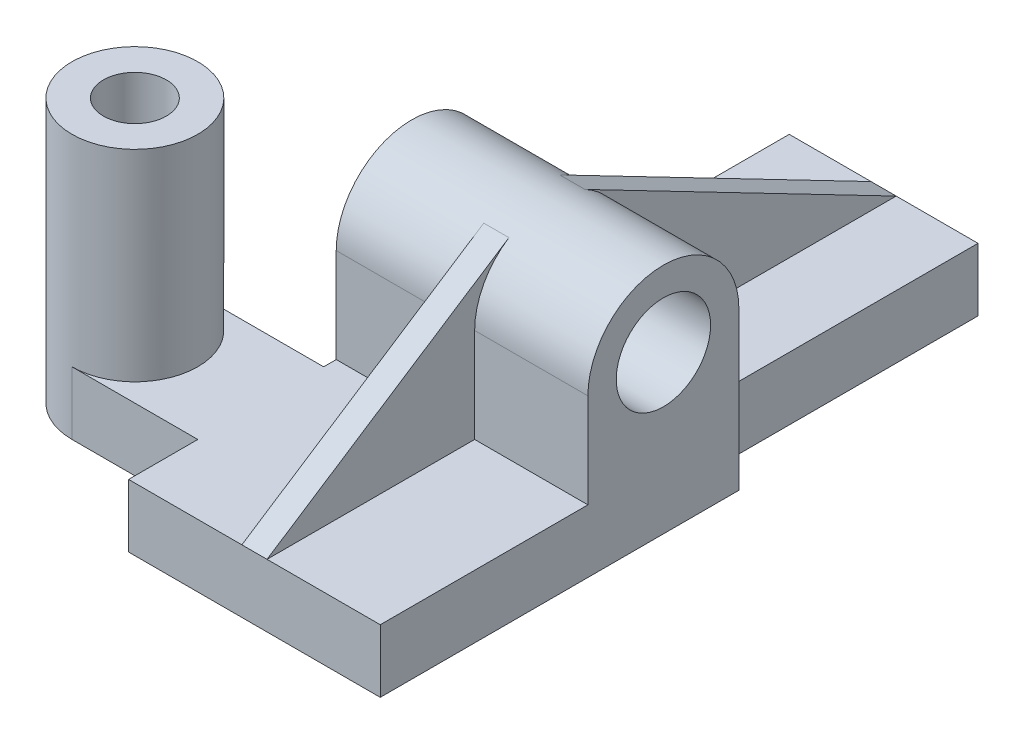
from build123d import *

# Parameters (mm, degrees)
EXTRUDE1_DEPTH             = 10
EXTRUDE2_DEPTH             = 40
EXTRUDE3_DEPTH             = 10
SKETCH6_R                  = 10
EXTRUDE4_DEPTH             = 42
RIB3_REACH                 = 121.432
SKETCH3_WALL_W             = 286.755153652
SKETCH3_WALL_H             = 4
RIB4_REACH                 = 121.432
SKETCH4_WALL_W             = 296.595477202
SKETCH4_WALL_H             = 4
F_10_0_10_DIAMETER_HOLE1_D = 10
F_15_0_15_DIAMETER_HOLE1_D = 15


with BuildPart() as part:
    # Sketch1 → Extrude1 (new body)
    with BuildSketch(Plane(origin=(0, 0, 0), x_dir=(1, 0, 0), z_dir=(0, 1, 0))):
        Polygon((-20, 0), (20, 0), (20, 57), (15, 57), (15, 100), (-15, 100), (-15, 57), (-20, 57), align=None)
    extrude(amount=EXTRUDE1_DEPTH)

    # Sketch2 → Extrude2 (add)
    with BuildSketch(Plane(origin=(20, 0, 0), x_dir=(0, 0, -1), z_dir=(1, 0, 0))):
        with BuildLine():
            Line((57, 10), (57, 25))
            ThreePointArc((57, 25), (45, 37), (33, 25))
            Line((33, 25), (33, 10))
            Line((33, 10), (57, 10))
        make_face()
    extrude(amount=-EXTRUDE2_DEPTH)

    # Sketch5 → Extrude3 (add)
    with BuildSketch(Plane(origin=(0, 0, 0), x_dir=(1, 0, 0), z_dir=(0, 1, 0))):
        with BuildLine():
            Line((-20, 11), (-40, 11))
            ThreePointArc((-40, 11), (-50, 21), (-40, 31))
            Line((-40, 31), (-20, 31))
            Line((-20, 31), (-20, 11))
        make_face()
    extrude(amount=EXTRUDE3_DEPTH)

    # Sketch6 → Extrude4 (add)
    with BuildSketch(Plane(origin=(0, 0, 0), x_dir=(1, 0, 0), z_dir=(0, 1, 0))):
        with Locations(Location((-40, 21, 0), (0, 0, 270))):
            Circle(SKETCH6_R)
    extrude(amount=EXTRUDE4_DEPTH)

    # Sketch3 wall → Rib3 (add, up to next)
    with BuildSketch(Plane(origin=(0, 22.526941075, -19.224352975), x_dir=(0, 0.545941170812, -0.837823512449), z_dir=(0, 0.837823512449, 0.545941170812)), mode=Mode.PRIVATE) as rib3_sk1:
        Rectangle(SKETCH3_WALL_W, SKETCH3_WALL_H)
    rib3_tool1 = extrude(rib3_sk1.sketch, amount=-RIB3_REACH, mode=Mode.PRIVATE) - part.part
    add(rib3_tool1.solids().sort_by_distance((0, 22.526941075, -19.224352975))[0])

    # Sketch4 wall → Rib4 (add, up to next)
    with BuildSketch(Plane(origin=(0, 22.826582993, -75.261795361), x_dir=(0, 0.46029922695, 0.887763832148), z_dir=(0, -0.887763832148, 0.46029922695)), mode=Mode.PRIVATE) as rib4_sk1:
        Rectangle(SKETCH4_WALL_W, SKETCH4_WALL_H)
    rib4_tool1 = extrude(rib4_sk1.sketch, amount=RIB4_REACH, mode=Mode.PRIVATE) - part.part
    add(rib4_tool1.solids().sort_by_distance((0, 22.826582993, -75.261795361))[0])

    # 10.0 _10_ Diameter Hole1 (through all)
    with Locations(Plane(origin=(0, 42, 0), x_dir=(-1, 0, 0), z_dir=(0, 1, 0))):
        with Locations((40, -21)):
            Hole(F_10_0_10_DIAMETER_HOLE1_D / 2)

    # 15.0 _15_ Diameter Hole1 (through all)
    with Locations(Plane.YZ.offset(20)):
        with Locations((25, -45)):
            Hole(F_15_0_15_DIAMETER_HOLE1_D / 2)


solid = part.part
